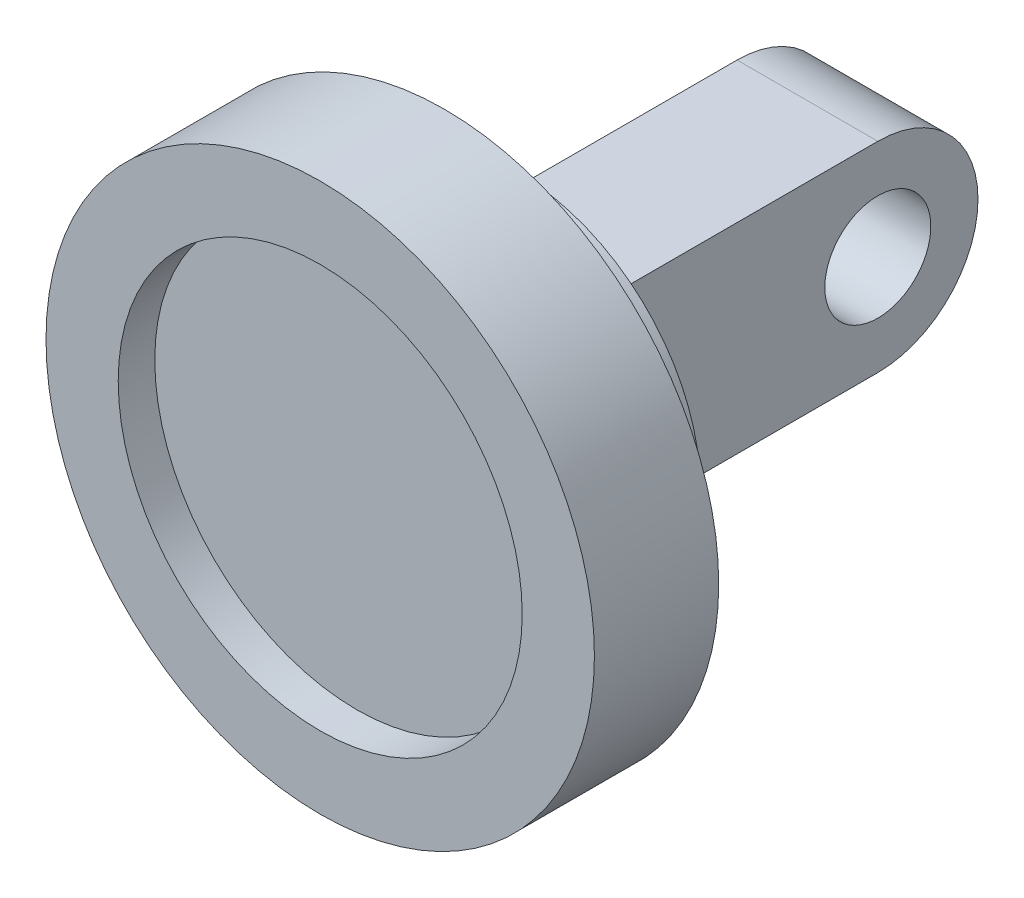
from build123d import *

# Parameters (mm, degrees)
CROQUIS3_W              = 77
CROQUIS3_H              = 184.583314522
SALIENTE_EXTRUIR1_DEPTH = 213.333333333
CORTAR_EXTRUIR1_DEPTH   = 800
CROQUIS6_R              = 29
CORTAR_EXTRUIR3_DEPTH   = 402.605977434


with BuildPart() as part:
    # Croquis1 → Revoluci_n1 (revolve)
    with BuildSketch(Plane(origin=(0, 0, 0), x_dir=(0, 0, -1), z_dir=(1, 0, 0)), mode=Mode.PRIVATE) as revoluci_n1_sk:
        Polygon((0, 110.5), (20, 110.5), (20, 0), (108, 0), (108, 100), (68, 100), (68, 150), (0, 150), align=None)
    revolve(revoluci_n1_sk.sketch.rotate(Axis((0, 0, 0), (0, 0, -1)), 90), axis=Axis((0, 0, 0), (0, 0, -1)))

    # Croquis3 → Saliente-Extruir1 (add)
    with BuildSketch(Plane(origin=(0, 0, -108), x_dir=(-1, 0, 0), z_dir=(0, 0, -1))):
        Rectangle(CROQUIS3_W, CROQUIS3_H)
    extrude(amount=SALIENTE_EXTRUIR1_DEPTH)

    # Croquis4 → Cortar-Extruir1 (cut)
    with BuildSketch(Plane(origin=(38.5, 0, 0), x_dir=(0, 0, -1), z_dir=(1, 0, 0))):
        with BuildLine():
            Line((108, 92.291657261), (108, 54.8))
            Line((108, 54.8), (266.533333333, 54.8))
            ThreePointArc((266.533333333, 54.8), (305.282784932, 38.749451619), (321.333333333, 2.8e-08))
            Line((321.333333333, 2.8e-08), (321.333333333, 92.291657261))
            Line((321.333333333, 92.291657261), (108, 92.291657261))
        make_face()
        with BuildLine():
            Line((266.533333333, -54.8), (108, -54.8))
            Line((108, -54.8), (108, -92.291657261))
            Line((108, -92.291657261), (321.333333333, -92.291657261))
            Line((321.333333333, -92.291657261), (321.333333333, 2.8e-08))
            ThreePointArc((321.333333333, 2.8e-08), (305.282784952, -38.749451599), (266.533333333, -54.8))
        make_face()
    extrude(amount=-CORTAR_EXTRUIR1_DEPTH, mode=Mode.SUBTRACT)

    # Croquis6 → Cortar-Extruir3 (cut, through all)
    with BuildSketch(Plane.ZY.offset(38.5)):
        with Locations((-266.533333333, 0)):
            Circle(CROQUIS6_R)
    extrude(amount=-CORTAR_EXTRUIR3_DEPTH, mode=Mode.SUBTRACT)


solid = part.part
